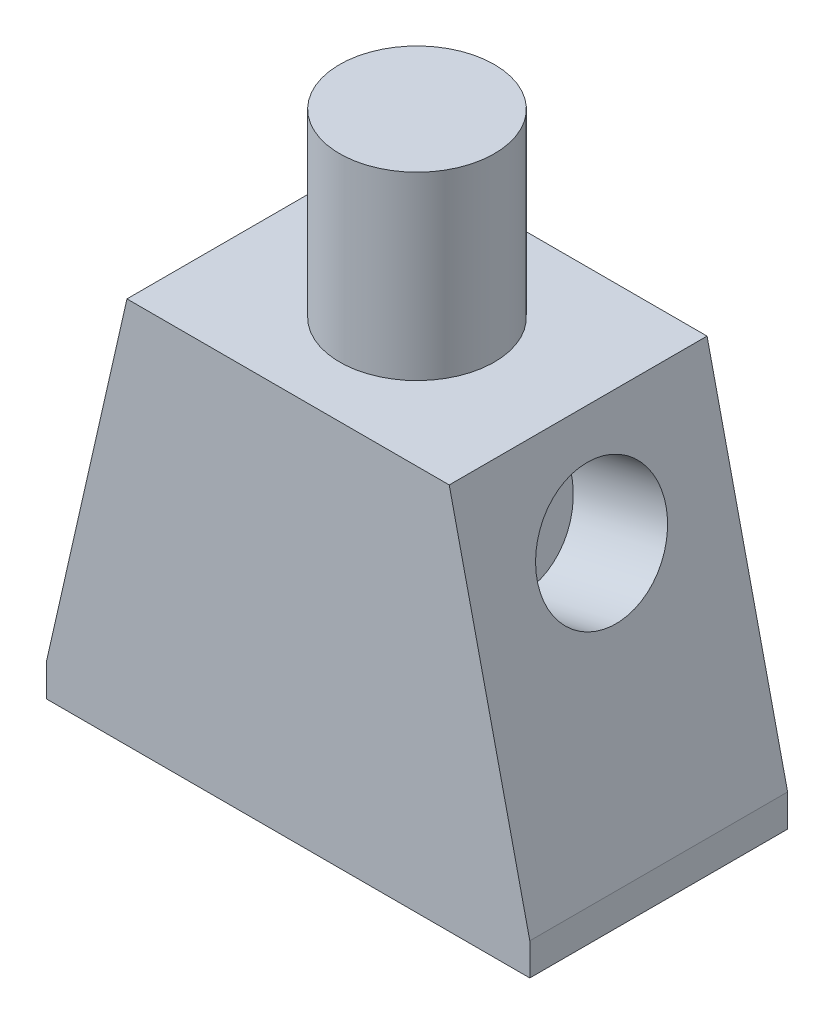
ISO-10303-21;
HEADER;
FILE_DESCRIPTION(('STEP AP214'),'2;1');
FILE_NAME('part.step','',(''),(''),'','','');
FILE_SCHEMA(('AUTOMOTIVE_DESIGN { 1 0 10303 214 1 1 1 1 }'));
ENDSEC;
DATA;
#1=APPLICATION_CONTEXT('core data for automotive mechanical design processes');
#2=APPLICATION_PROTOCOL_DEFINITION('international standard','automotive_design',2000,#1);
#3=PRODUCT_CONTEXT('',#1,'mechanical');
#4=PRODUCT('Part','Part','',(#3));
#5=PRODUCT_RELATED_PRODUCT_CATEGORY('part','',(#4));
#6=PRODUCT_DEFINITION_FORMATION('','',#4);
#7=PRODUCT_DEFINITION_CONTEXT('part definition',#1,'design');
#8=PRODUCT_DEFINITION('design','',#6,#7);
#9=PRODUCT_DEFINITION_SHAPE('','',#8);
#10=(LENGTH_UNIT() NAMED_UNIT(*) SI_UNIT(.MILLI.,.METRE.));
#11=(NAMED_UNIT(*) PLANE_ANGLE_UNIT() SI_UNIT($,.RADIAN.));
#12=(NAMED_UNIT(*) SI_UNIT($,.STERADIAN.) SOLID_ANGLE_UNIT());
#13=UNCERTAINTY_MEASURE_WITH_UNIT(LENGTH_MEASURE(1.E-05),#10,'distance_accuracy_value','');
#14=(GEOMETRIC_REPRESENTATION_CONTEXT(3) GLOBAL_UNCERTAINTY_ASSIGNED_CONTEXT((#13)) GLOBAL_UNIT_ASSIGNED_CONTEXT((#10,
#11,#12)) REPRESENTATION_CONTEXT('',''));
#15=CARTESIAN_POINT('',(0.,0.,0.));
#16=DIRECTION('',(0.,0.,1.));
#17=DIRECTION('',(1.,0.,0.));
#18=AXIS2_PLACEMENT_3D('',#15,#16,#17);
#19=CARTESIAN_POINT('',(4.12,33.6,-0.495));
#20=DIRECTION('',(0.,1.,0.));
#21=DIRECTION('',(1.,0.,0.));
#22=AXIS2_PLACEMENT_3D('',#19,#20,#21);
#23=PLANE('',#22);
#24=CARTESIAN_POINT('',(4.12,33.6,-0.495));
#25=DIRECTION('',(0.,1.,0.));
#26=DIRECTION('',(0.,0.,1.));
#27=AXIS2_PLACEMENT_3D('',#24,#25,#26);
#28=CIRCLE('',#27,2.4);
#29=CARTESIAN_POINT('',(4.12,33.6,-2.895));
#30=VERTEX_POINT('',#29);
#31=EDGE_CURVE('E189',#30,#30,#28,.T.);
#32=ORIENTED_EDGE('',*,*,#31,.T.);
#33=EDGE_LOOP('',(#32));
#34=FACE_BOUND('',#33,.T.);
#35=ADVANCED_FACE('F19',(#34),#23,.T.);
#36=CARTESIAN_POINT('',(6.92163260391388,24.1361995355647,-0.495));
#37=DIRECTION('',(0.97513285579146,0.221621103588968,0.));
#38=DIRECTION('',(0.,0.,-1.));
#39=AXIS2_PLACEMENT_3D('',#36,#37,#38);
#40=PLANE('',#39);
#41=CARTESIAN_POINT('',(6.92163260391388,24.1361995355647,-0.495));
#42=DIRECTION('',(0.97513285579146,0.221621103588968,0.));
#43=DIRECTION('',(-0.221621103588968,0.97513285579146,0.));
#44=AXIS2_PLACEMENT_3D('',#41,#42,#43);
#45=CIRCLE('',#44,2.);
#46=CARTESIAN_POINT('',(6.47839039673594,26.0864652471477,-0.495));
#47=VERTEX_POINT('',#46);
#48=EDGE_CURVE('E188',#47,#47,#45,.T.);
#49=ORIENTED_EDGE('',*,*,#48,.T.);
#50=EDGE_LOOP('',(#49));
#51=FACE_BOUND('',#50,.T.);
#52=ADVANCED_FACE('F287',(#51),#40,.T.);
#53=CARTESIAN_POINT('',(1.31836739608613,24.1361995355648,-0.495));
#54=DIRECTION('',(-0.97513285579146,0.221621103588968,0.));
#55=DIRECTION('',(0.,0.,1.));
#56=AXIS2_PLACEMENT_3D('',#53,#54,#55);
#57=PLANE('',#56);
#58=CARTESIAN_POINT('',(1.31836739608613,24.1361995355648,-0.495));
#59=DIRECTION('',(-0.97513285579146,0.221621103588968,0.));
#60=DIRECTION('',(-0.221621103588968,-0.97513285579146,0.));
#61=AXIS2_PLACEMENT_3D('',#58,#59,#60);
#62=CIRCLE('',#61,2.);
#63=CARTESIAN_POINT('',(0.87512518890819,22.1859338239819,-0.495));
#64=VERTEX_POINT('',#63);
#65=EDGE_CURVE('E193',#64,#64,#62,.T.);
#66=ORIENTED_EDGE('',*,*,#65,.T.);
#67=EDGE_LOOP('',(#66));
#68=FACE_BOUND('',#67,.T.);
#69=ADVANCED_FACE('F292',(#68),#57,.T.);
#70=CARTESIAN_POINT('',(7.9550986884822,20.,-0.5));
#71=DIRECTION('',(0.,-1.,0.));
#72=DIRECTION('',(0.,0.,-1.));
#73=AXIS2_PLACEMENT_3D('',#70,#71,#72);
#74=PLANE('',#73);
#75=CARTESIAN_POINT('',(7.9550986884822,20.,-0.5));
#76=DIRECTION('',(0.,-1.,0.));
#77=DIRECTION('',(0.,0.,-1.));
#78=AXIS2_PLACEMENT_3D('',#75,#76,#77);
#79=CIRCLE('',#78,2.1);
#80=CARTESIAN_POINT('',(9.65709487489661,20.,0.730125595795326));
#81=VERTEX_POINT('',#80);
#82=CARTESIAN_POINT('',(9.65709487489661,20.,-1.73012559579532));
#83=VERTEX_POINT('',#82);
#84=EDGE_CURVE('E184',#81,#83,#79,.T.);
#85=ORIENTED_EDGE('',*,*,#84,.T.);
#86=DIRECTION('',(0.,0.,1.));
#87=VECTOR('',#86,1.);
#88=CARTESIAN_POINT('',(9.65709487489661,20.,-1.73012559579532));
#89=LINE('',#88,#87);
#90=EDGE_CURVE('E11',#83,#81,#89,.T.);
#91=ORIENTED_EDGE('',*,*,#90,.T.);
#92=EDGE_LOOP('',(#85,#91));
#93=FACE_BOUND('',#92,.T.);
#94=ADVANCED_FACE('F325',(#93),#74,.T.);
#95=CARTESIAN_POINT('',(9.65709487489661,20.,-1.73012559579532));
#96=DIRECTION('',(1.,0.,0.));
#97=DIRECTION('',(0.,1.,0.));
#98=AXIS2_PLACEMENT_3D('',#95,#96,#97);
#99=PLANE('',#98);
#100=DIRECTION('',(0.,0.,1.));
#101=VECTOR('',#100,1.);
#102=CARTESIAN_POINT('',(9.65709487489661,16.,-1.73012559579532));
#103=LINE('',#102,#101);
#104=CARTESIAN_POINT('',(9.65709487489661,16.,-1.73012559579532));
#105=VERTEX_POINT('',#104);
#106=CARTESIAN_POINT('',(9.65709487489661,16.,0.730125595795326));
#107=VERTEX_POINT('',#106);
#108=EDGE_CURVE('E222',#105,#107,#103,.T.);
#109=ORIENTED_EDGE('',*,*,#108,.T.);
#110=DIRECTION('',(0.,-1.,0.));
#111=VECTOR('',#110,1.);
#112=CARTESIAN_POINT('',(9.65709487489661,20.,0.730125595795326));
#113=LINE('',#112,#111);
#114=EDGE_CURVE('E180',#81,#107,#113,.T.);
#115=ORIENTED_EDGE('',*,*,#114,.F.);
#116=ORIENTED_EDGE('',*,*,#90,.F.);
#117=DIRECTION('',(0.,-1.,0.));
#118=VECTOR('',#117,1.);
#119=CARTESIAN_POINT('',(9.65709487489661,20.,-1.73012559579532));
#120=LINE('',#119,#118);
#121=EDGE_CURVE('E241',#83,#105,#120,.T.);
#122=ORIENTED_EDGE('',*,*,#121,.T.);
#123=EDGE_LOOP('',(#109,#115,#116,#122));
#124=FACE_BOUND('',#123,.T.);
#125=ADVANCED_FACE('F314',(#124),#99,.F.);
#126=CARTESIAN_POINT('',(0.2849013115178,20.,-0.5));
#127=DIRECTION('',(0.,1.,0.));
#128=DIRECTION('',(1.,0.,0.));
#129=AXIS2_PLACEMENT_3D('',#126,#127,#128);
#130=PLANE('',#129);
#131=CARTESIAN_POINT('',(0.2849013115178,20.,-0.5));
#132=DIRECTION('',(0.,-1.,0.));
#133=DIRECTION('',(0.,0.,1.));
#134=AXIS2_PLACEMENT_3D('',#131,#132,#133);
#135=CIRCLE('',#134,2.1);
#136=CARTESIAN_POINT('',(-1.41709487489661,20.,-1.73012559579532));
#137=VERTEX_POINT('',#136);
#138=CARTESIAN_POINT('',(-1.41709487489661,20.,0.730125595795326));
#139=VERTEX_POINT('',#138);
#140=EDGE_CURVE('E200',#137,#139,#135,.T.);
#141=ORIENTED_EDGE('',*,*,#140,.T.);
#142=DIRECTION('',(0.,0.,-1.));
#143=VECTOR('',#142,1.);
#144=CARTESIAN_POINT('',(-1.41709487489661,20.,-1.73012559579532));
#145=LINE('',#144,#143);
#146=EDGE_CURVE('E30',#139,#137,#145,.T.);
#147=ORIENTED_EDGE('',*,*,#146,.T.);
#148=EDGE_LOOP('',(#141,#147));
#149=FACE_BOUND('',#148,.T.);
#150=ADVANCED_FACE('F304',(#149),#130,.F.);
#151=CARTESIAN_POINT('',(-1.41709487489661,20.,-1.73012559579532));
#152=DIRECTION('',(-1.,0.,0.));
#153=DIRECTION('',(0.,0.,1.));
#154=AXIS2_PLACEMENT_3D('',#151,#152,#153);
#155=PLANE('',#154);
#156=DIRECTION('',(0.,0.,-1.));
#157=VECTOR('',#156,1.);
#158=CARTESIAN_POINT('',(-1.41709487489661,16.,-1.73012559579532));
#159=LINE('',#158,#157);
#160=CARTESIAN_POINT('',(-1.41709487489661,16.,0.730125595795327));
#161=VERTEX_POINT('',#160);
#162=CARTESIAN_POINT('',(-1.41709487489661,16.,-1.73012559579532));
#163=VERTEX_POINT('',#162);
#164=EDGE_CURVE('E230',#161,#163,#159,.T.);
#165=ORIENTED_EDGE('',*,*,#164,.T.);
#166=DIRECTION('',(0.,-1.,0.));
#167=VECTOR('',#166,1.);
#168=CARTESIAN_POINT('',(-1.41709487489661,20.,-1.73012559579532));
#169=LINE('',#168,#167);
#170=EDGE_CURVE('E196',#137,#163,#169,.T.);
#171=ORIENTED_EDGE('',*,*,#170,.F.);
#172=ORIENTED_EDGE('',*,*,#146,.F.);
#173=DIRECTION('',(0.,-1.,0.));
#174=VECTOR('',#173,1.);
#175=CARTESIAN_POINT('',(-1.41709487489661,20.,0.730125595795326));
#176=LINE('',#175,#174);
#177=EDGE_CURVE('E169',#139,#161,#176,.T.);
#178=ORIENTED_EDGE('',*,*,#177,.T.);
#179=EDGE_LOOP('',(#165,#171,#172,#178));
#180=FACE_BOUND('',#179,.T.);
#181=ADVANCED_FACE('F301',(#180),#155,.F.);
#182=CARTESIAN_POINT('',(-3.38,16.,3.505));
#183=DIRECTION('',(0.,0.,-1.));
#184=DIRECTION('',(0.,-1.,0.));
#185=AXIS2_PLACEMENT_3D('',#182,#183,#184);
#186=PLANE('',#185);
#187=DIRECTION('',(0.,-1.,0.));
#188=VECTOR('',#187,1.);
#189=CARTESIAN_POINT('',(-3.38,16.,3.505));
#190=LINE('',#189,#188);
#191=CARTESIAN_POINT('',(-3.38,17.,3.505));
#192=VERTEX_POINT('',#191);
#193=CARTESIAN_POINT('',(-3.38,16.,3.505));
#194=VERTEX_POINT('',#193);
#195=EDGE_CURVE('E160',#192,#194,#190,.T.);
#196=ORIENTED_EDGE('',*,*,#195,.T.);
#197=DIRECTION('',(1.,0.,0.));
#198=VECTOR('',#197,1.);
#199=CARTESIAN_POINT('',(-3.38,16.,3.505));
#200=LINE('',#199,#198);
#201=CARTESIAN_POINT('',(11.62,16.,3.505));
#202=VERTEX_POINT('',#201);
#203=EDGE_CURVE('E210',#194,#202,#200,.T.);
#204=ORIENTED_EDGE('',*,*,#203,.T.);
#205=DIRECTION('',(0.,1.,0.));
#206=VECTOR('',#205,1.);
#207=CARTESIAN_POINT('',(11.62,16.,3.505));
#208=LINE('',#207,#206);
#209=CARTESIAN_POINT('',(11.62,17.,3.505));
#210=VERTEX_POINT('',#209);
#211=EDGE_CURVE('E205',#202,#210,#208,.T.);
#212=ORIENTED_EDGE('',*,*,#211,.T.);
#213=DIRECTION('',(-0.221621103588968,0.97513285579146,0.));
#214=VECTOR('',#213,1.);
#215=CARTESIAN_POINT('',(9.12,28.,3.505));
#216=LINE('',#215,#214);
#217=CARTESIAN_POINT('',(9.12,28.,3.505));
#218=VERTEX_POINT('',#217);
#219=EDGE_CURVE('E165',#210,#218,#216,.T.);
#220=ORIENTED_EDGE('',*,*,#219,.T.);
#221=DIRECTION('',(-1.,0.,0.));
#222=VECTOR('',#221,1.);
#223=CARTESIAN_POINT('',(-0.88,28.,3.505));
#224=LINE('',#223,#222);
#225=CARTESIAN_POINT('',(-0.88,28.,3.505));
#226=VERTEX_POINT('',#225);
#227=EDGE_CURVE('E156',#218,#226,#224,.T.);
#228=ORIENTED_EDGE('',*,*,#227,.T.);
#229=DIRECTION('',(-0.221621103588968,-0.97513285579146,0.));
#230=VECTOR('',#229,1.);
#231=CARTESIAN_POINT('',(-0.88,28.,3.505));
#232=LINE('',#231,#230);
#233=EDGE_CURVE('E138',#226,#192,#232,.T.);
#234=ORIENTED_EDGE('',*,*,#233,.T.);
#235=EDGE_LOOP('',(#196,#204,#212,#220,#228,#234));
#236=FACE_BOUND('',#235,.T.);
#237=ADVANCED_FACE('F162',(#236),#186,.F.);
#238=CARTESIAN_POINT('',(-3.38,16.,-4.495));
#239=DIRECTION('',(0.,0.,-1.));
#240=DIRECTION('',(0.,-1.,0.));
#241=AXIS2_PLACEMENT_3D('',#238,#239,#240);
#242=PLANE('',#241);
#243=DIRECTION('',(0.,-1.,0.));
#244=VECTOR('',#243,1.);
#245=CARTESIAN_POINT('',(-3.38,16.,-4.495));
#246=LINE('',#245,#244);
#247=CARTESIAN_POINT('',(-3.38,17.,-4.495));
#248=VERTEX_POINT('',#247);
#249=CARTESIAN_POINT('',(-3.38,16.,-4.495));
#250=VERTEX_POINT('',#249);
#251=EDGE_CURVE('E204',#248,#250,#246,.T.);
#252=ORIENTED_EDGE('',*,*,#251,.F.);
#253=DIRECTION('',(-0.221621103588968,-0.97513285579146,0.));
#254=VECTOR('',#253,1.);
#255=CARTESIAN_POINT('',(-0.88,28.,-4.495));
#256=LINE('',#255,#254);
#257=CARTESIAN_POINT('',(-0.88,28.,-4.495));
#258=VERTEX_POINT('',#257);
#259=EDGE_CURVE('E23',#258,#248,#256,.T.);
#260=ORIENTED_EDGE('',*,*,#259,.F.);
#261=DIRECTION('',(-1.,0.,0.));
#262=VECTOR('',#261,1.);
#263=CARTESIAN_POINT('',(-0.88,28.,-4.495));
#264=LINE('',#263,#262);
#265=CARTESIAN_POINT('',(9.12,28.,-4.495));
#266=VERTEX_POINT('',#265);
#267=EDGE_CURVE('E158',#266,#258,#264,.T.);
#268=ORIENTED_EDGE('',*,*,#267,.F.);
#269=DIRECTION('',(-0.221621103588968,0.97513285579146,0.));
#270=VECTOR('',#269,1.);
#271=CARTESIAN_POINT('',(9.12,28.,-4.495));
#272=LINE('',#271,#270);
#273=CARTESIAN_POINT('',(11.62,17.,-4.495));
#274=VERTEX_POINT('',#273);
#275=EDGE_CURVE('E209',#274,#266,#272,.T.);
#276=ORIENTED_EDGE('',*,*,#275,.F.);
#277=DIRECTION('',(0.,1.,0.));
#278=VECTOR('',#277,1.);
#279=CARTESIAN_POINT('',(11.62,16.,-4.495));
#280=LINE('',#279,#278);
#281=CARTESIAN_POINT('',(11.62,16.,-4.495));
#282=VERTEX_POINT('',#281);
#283=EDGE_CURVE('E213',#282,#274,#280,.T.);
#284=ORIENTED_EDGE('',*,*,#283,.F.);
#285=DIRECTION('',(1.,0.,0.));
#286=VECTOR('',#285,1.);
#287=CARTESIAN_POINT('',(-3.38,16.,-4.495));
#288=LINE('',#287,#286);
#289=EDGE_CURVE('E45',#250,#282,#288,.T.);
#290=ORIENTED_EDGE('',*,*,#289,.F.);
#291=EDGE_LOOP('',(#252,#260,#268,#276,#284,#290));
#292=FACE_BOUND('',#291,.T.);
#293=ADVANCED_FACE('F327',(#292),#242,.T.);
#294=CARTESIAN_POINT('',(-3.38,16.,-4.495));
#295=DIRECTION('',(0.,-1.,0.));
#296=DIRECTION('',(0.,0.,-1.));
#297=AXIS2_PLACEMENT_3D('',#294,#295,#296);
#298=PLANE('',#297);
#299=CARTESIAN_POINT('',(0.2849013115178,16.,-0.5));
#300=DIRECTION('',(0.,-1.,0.));
#301=DIRECTION('',(0.,0.,1.));
#302=AXIS2_PLACEMENT_3D('',#299,#300,#301);
#303=CIRCLE('',#302,2.1);
#304=EDGE_CURVE('E177',#163,#161,#303,.T.);
#305=ORIENTED_EDGE('',*,*,#304,.F.);
#306=ORIENTED_EDGE('',*,*,#164,.F.);
#307=EDGE_LOOP('',(#305,#306));
#308=FACE_BOUND('',#307,.T.);
#309=CARTESIAN_POINT('',(7.9550986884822,16.,-0.5));
#310=DIRECTION('',(0.,-1.,0.));
#311=DIRECTION('',(0.,0.,-1.));
#312=AXIS2_PLACEMENT_3D('',#309,#310,#311);
#313=CIRCLE('',#312,2.1);
#314=EDGE_CURVE('E183',#107,#105,#313,.T.);
#315=ORIENTED_EDGE('',*,*,#314,.F.);
#316=ORIENTED_EDGE('',*,*,#108,.F.);
#317=EDGE_LOOP('',(#315,#316));
#318=FACE_BOUND('',#317,.T.);
#319=ORIENTED_EDGE('',*,*,#203,.F.);
#320=DIRECTION('',(0.,0.,1.));
#321=VECTOR('',#320,1.);
#322=CARTESIAN_POINT('',(-3.38,16.,-4.495));
#323=LINE('',#322,#321);
#324=EDGE_CURVE('E150',#250,#194,#323,.T.);
#325=ORIENTED_EDGE('',*,*,#324,.F.);
#326=ORIENTED_EDGE('',*,*,#289,.T.);
#327=DIRECTION('',(0.,0.,1.));
#328=VECTOR('',#327,1.);
#329=CARTESIAN_POINT('',(11.62,16.,-4.495));
#330=LINE('',#329,#328);
#331=EDGE_CURVE('E208',#282,#202,#330,.T.);
#332=ORIENTED_EDGE('',*,*,#331,.T.);
#333=EDGE_LOOP('',(#319,#325,#326,#332));
#334=FACE_BOUND('',#333,.T.);
#335=ADVANCED_FACE('F310',(#308,#318,#334),#298,.T.);
#336=CARTESIAN_POINT('',(11.62,16.,-4.495));
#337=DIRECTION('',(1.,0.,0.));
#338=DIRECTION('',(0.,1.,0.));
#339=AXIS2_PLACEMENT_3D('',#336,#337,#338);
#340=PLANE('',#339);
#341=ORIENTED_EDGE('',*,*,#211,.F.);
#342=ORIENTED_EDGE('',*,*,#331,.F.);
#343=ORIENTED_EDGE('',*,*,#283,.T.);
#344=DIRECTION('',(0.,0.,1.));
#345=VECTOR('',#344,1.);
#346=CARTESIAN_POINT('',(11.62,17.,-4.495));
#347=LINE('',#346,#345);
#348=EDGE_CURVE('E228',#274,#210,#347,.T.);
#349=ORIENTED_EDGE('',*,*,#348,.T.);
#350=EDGE_LOOP('',(#341,#342,#343,#349));
#351=FACE_BOUND('',#350,.T.);
#352=ADVANCED_FACE('F306',(#351),#340,.T.);
#353=CARTESIAN_POINT('',(9.12,28.,-4.495));
#354=DIRECTION('',(0.97513285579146,0.221621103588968,0.));
#355=DIRECTION('',(0.,0.,-1.));
#356=AXIS2_PLACEMENT_3D('',#353,#354,#355);
#357=PLANE('',#356);
#358=CARTESIAN_POINT('',(9.84703117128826,24.8010628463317,-0.495));
#359=DIRECTION('',(0.97513285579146,0.221621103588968,0.));
#360=DIRECTION('',(-0.221621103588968,0.97513285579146,0.));
#361=AXIS2_PLACEMENT_3D('',#358,#359,#360);
#362=CIRCLE('',#361,2.);
#363=CARTESIAN_POINT('',(9.40378896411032,26.7513285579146,-0.495));
#364=VERTEX_POINT('',#363);
#365=EDGE_CURVE('E216',#364,#364,#362,.T.);
#366=ORIENTED_EDGE('',*,*,#365,.F.);
#367=EDGE_LOOP('',(#366));
#368=FACE_BOUND('',#367,.T.);
#369=ORIENTED_EDGE('',*,*,#219,.F.);
#370=ORIENTED_EDGE('',*,*,#348,.F.);
#371=ORIENTED_EDGE('',*,*,#275,.T.);
#372=DIRECTION('',(0.,0.,1.));
#373=VECTOR('',#372,1.);
#374=CARTESIAN_POINT('',(9.12,28.,-4.495));
#375=LINE('',#374,#373);
#376=EDGE_CURVE('E168',#266,#218,#375,.T.);
#377=ORIENTED_EDGE('',*,*,#376,.T.);
#378=EDGE_LOOP('',(#369,#370,#371,#377));
#379=FACE_BOUND('',#378,.T.);
#380=ADVANCED_FACE('F309',(#368,#379),#357,.T.);
#381=CARTESIAN_POINT('',(-0.88,28.,-4.495));
#382=DIRECTION('',(-0.97513285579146,0.221621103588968,0.));
#383=DIRECTION('',(0.,0.,1.));
#384=AXIS2_PLACEMENT_3D('',#381,#382,#383);
#385=PLANE('',#384);
#386=CARTESIAN_POINT('',(-1.60703117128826,24.8010628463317,-0.495));
#387=DIRECTION('',(-0.97513285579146,0.221621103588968,0.));
#388=DIRECTION('',(-0.221621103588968,-0.97513285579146,0.));
#389=AXIS2_PLACEMENT_3D('',#386,#387,#388);
#390=CIRCLE('',#389,2.);
#391=CARTESIAN_POINT('',(-2.05027337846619,22.8507971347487,-0.495));
#392=VERTEX_POINT('',#391);
#393=EDGE_CURVE('E190',#392,#392,#390,.T.);
#394=ORIENTED_EDGE('',*,*,#393,.F.);
#395=EDGE_LOOP('',(#394));
#396=FACE_BOUND('',#395,.T.);
#397=ORIENTED_EDGE('',*,*,#233,.F.);
#398=DIRECTION('',(0.,0.,1.));
#399=VECTOR('',#398,1.);
#400=CARTESIAN_POINT('',(-0.88,28.,-4.495));
#401=LINE('',#400,#399);
#402=EDGE_CURVE('E141',#258,#226,#401,.T.);
#403=ORIENTED_EDGE('',*,*,#402,.F.);
#404=ORIENTED_EDGE('',*,*,#259,.T.);
#405=DIRECTION('',(0.,0.,1.));
#406=VECTOR('',#405,1.);
#407=CARTESIAN_POINT('',(-3.38,17.,-4.495));
#408=LINE('',#407,#406);
#409=EDGE_CURVE('E144',#248,#192,#408,.T.);
#410=ORIENTED_EDGE('',*,*,#409,.T.);
#411=EDGE_LOOP('',(#397,#403,#404,#410));
#412=FACE_BOUND('',#411,.T.);
#413=ADVANCED_FACE('F140',(#396,#412),#385,.T.);
#414=CARTESIAN_POINT('',(-3.38,16.,-4.495));
#415=DIRECTION('',(-1.,0.,0.));
#416=DIRECTION('',(0.,0.,1.));
#417=AXIS2_PLACEMENT_3D('',#414,#415,#416);
#418=PLANE('',#417);
#419=ORIENTED_EDGE('',*,*,#195,.F.);
#420=ORIENTED_EDGE('',*,*,#409,.F.);
#421=ORIENTED_EDGE('',*,*,#251,.T.);
#422=ORIENTED_EDGE('',*,*,#324,.T.);
#423=EDGE_LOOP('',(#419,#420,#421,#422));
#424=FACE_BOUND('',#423,.T.);
#425=ADVANCED_FACE('F319',(#424),#418,.T.);
#426=CARTESIAN_POINT('',(-0.88,28.,-4.495));
#427=DIRECTION('',(0.,1.,0.));
#428=DIRECTION('',(1.,0.,0.));
#429=AXIS2_PLACEMENT_3D('',#426,#427,#428);
#430=PLANE('',#429);
#431=CARTESIAN_POINT('',(4.12,28.,-0.495));
#432=DIRECTION('',(0.,1.,0.));
#433=DIRECTION('',(0.,0.,1.));
#434=AXIS2_PLACEMENT_3D('',#431,#432,#433);
#435=CIRCLE('',#434,2.4);
#436=CARTESIAN_POINT('',(4.12,28.,-2.895));
#437=VERTEX_POINT('',#436);
#438=EDGE_CURVE('E185',#437,#437,#435,.T.);
#439=ORIENTED_EDGE('',*,*,#438,.F.);
#440=EDGE_LOOP('',(#439));
#441=FACE_BOUND('',#440,.T.);
#442=ORIENTED_EDGE('',*,*,#227,.F.);
#443=ORIENTED_EDGE('',*,*,#376,.F.);
#444=ORIENTED_EDGE('',*,*,#267,.T.);
#445=ORIENTED_EDGE('',*,*,#402,.T.);
#446=EDGE_LOOP('',(#442,#443,#444,#445));
#447=FACE_BOUND('',#446,.T.);
#448=ADVANCED_FACE('F154',(#441,#447),#430,.T.);
#449=CARTESIAN_POINT('',(0.2849013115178,20.,-0.5));
#450=DIRECTION('',(0.,-1.,0.));
#451=DIRECTION('',(0.,0.,-1.));
#452=AXIS2_PLACEMENT_3D('',#449,#450,#451);
#453=CYLINDRICAL_SURFACE('',#452,2.1);
#454=ORIENTED_EDGE('',*,*,#140,.F.);
#455=ORIENTED_EDGE('',*,*,#170,.T.);
#456=ORIENTED_EDGE('',*,*,#304,.T.);
#457=ORIENTED_EDGE('',*,*,#177,.F.);
#458=EDGE_LOOP('',(#454,#455,#456,#457));
#459=FACE_BOUND('',#458,.T.);
#460=ADVANCED_FACE('F21',(#459),#453,.F.);
#461=CARTESIAN_POINT('',(7.9550986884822,20.,-0.5));
#462=DIRECTION('',(0.,-1.,0.));
#463=DIRECTION('',(0.,0.,-1.));
#464=AXIS2_PLACEMENT_3D('',#461,#462,#463);
#465=CYLINDRICAL_SURFACE('',#464,2.1);
#466=ORIENTED_EDGE('',*,*,#84,.F.);
#467=ORIENTED_EDGE('',*,*,#114,.T.);
#468=ORIENTED_EDGE('',*,*,#314,.T.);
#469=ORIENTED_EDGE('',*,*,#121,.F.);
#470=EDGE_LOOP('',(#466,#467,#468,#469));
#471=FACE_BOUND('',#470,.T.);
#472=ADVANCED_FACE('F297',(#471),#465,.F.);
#473=CARTESIAN_POINT('',(1.31836739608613,24.1361995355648,-0.495));
#474=DIRECTION('',(-0.97513285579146,0.221621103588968,0.));
#475=DIRECTION('',(-0.221621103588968,-0.97513285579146,0.));
#476=AXIS2_PLACEMENT_3D('',#473,#474,#475);
#477=CYLINDRICAL_SURFACE('',#476,2.);
#478=ORIENTED_EDGE('',*,*,#393,.T.);
#479=EDGE_LOOP('',(#478));
#480=FACE_BOUND('',#479,.T.);
#481=ORIENTED_EDGE('',*,*,#65,.F.);
#482=EDGE_LOOP('',(#481));
#483=FACE_BOUND('',#482,.T.);
#484=ADVANCED_FACE('F282',(#480,#483),#477,.F.);
#485=CARTESIAN_POINT('',(6.92163260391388,24.1361995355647,-0.495));
#486=DIRECTION('',(0.97513285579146,0.221621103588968,0.));
#487=DIRECTION('',(-0.221621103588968,0.97513285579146,0.));
#488=AXIS2_PLACEMENT_3D('',#485,#486,#487);
#489=CYLINDRICAL_SURFACE('',#488,2.);
#490=ORIENTED_EDGE('',*,*,#365,.T.);
#491=EDGE_LOOP('',(#490));
#492=FACE_BOUND('',#491,.T.);
#493=ORIENTED_EDGE('',*,*,#48,.F.);
#494=EDGE_LOOP('',(#493));
#495=FACE_BOUND('',#494,.T.);
#496=ADVANCED_FACE('F275',(#492,#495),#489,.F.);
#497=CARTESIAN_POINT('',(4.12,33.6,-0.495));
#498=DIRECTION('',(0.,-1.,0.));
#499=DIRECTION('',(0.,0.,-1.));
#500=AXIS2_PLACEMENT_3D('',#497,#498,#499);
#501=CYLINDRICAL_SURFACE('',#500,2.4);
#502=ORIENTED_EDGE('',*,*,#438,.T.);
#503=EDGE_LOOP('',(#502));
#504=FACE_BOUND('',#503,.T.);
#505=ORIENTED_EDGE('',*,*,#31,.F.);
#506=EDGE_LOOP('',(#505));
#507=FACE_BOUND('',#506,.T.);
#508=ADVANCED_FACE('F273',(#504,#507),#501,.T.);
#509=CLOSED_SHELL('',(#35,#52,#69,#94,#125,#150,#181,#237,#293,#335,#352,#380,#413,#425,#448,
#460,#472,#484,#496,#508));
#510=MANIFOLD_SOLID_BREP('B1',#509);
#511=ADVANCED_BREP_SHAPE_REPRESENTATION('',(#18,#510),#14);
#512=SHAPE_DEFINITION_REPRESENTATION(#9,#511);
ENDSEC;
END-ISO-10303-21;
